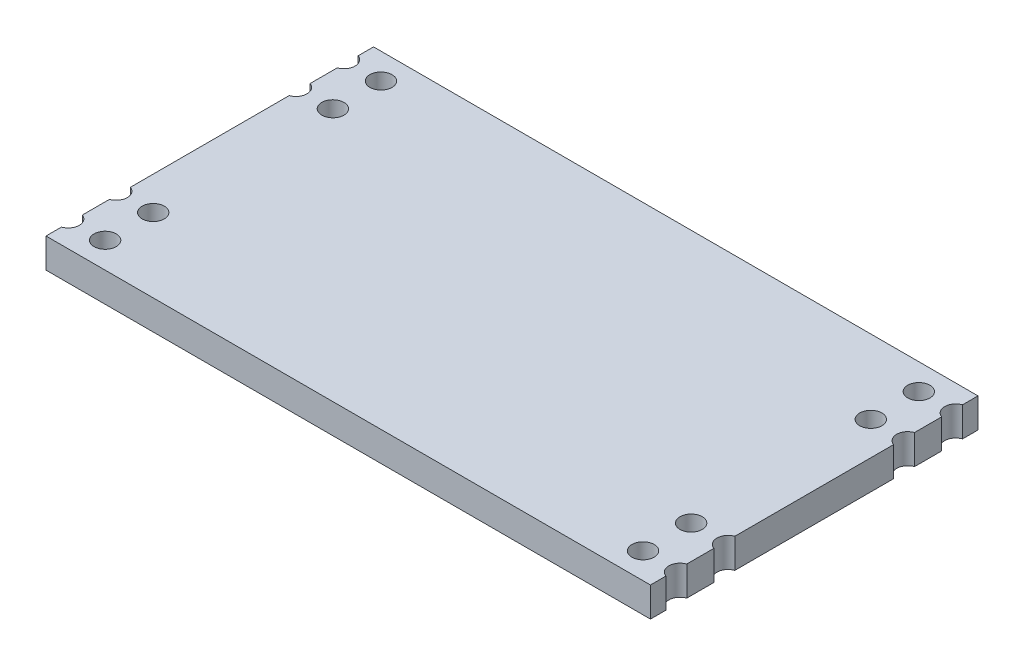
ISO-10303-21;
HEADER;
FILE_DESCRIPTION(('STEP AP214'),'2;1');
FILE_NAME('part.step','',(''),(''),'','','');
FILE_SCHEMA(('AUTOMOTIVE_DESIGN { 1 0 10303 214 1 1 1 1 }'));
ENDSEC;
DATA;
#1=APPLICATION_CONTEXT('core data for automotive mechanical design processes');
#2=APPLICATION_PROTOCOL_DEFINITION('international standard','automotive_design',2000,#1);
#3=PRODUCT_CONTEXT('',#1,'mechanical');
#4=PRODUCT('Part','Part','',(#3));
#5=PRODUCT_RELATED_PRODUCT_CATEGORY('part','',(#4));
#6=PRODUCT_DEFINITION_FORMATION('','',#4);
#7=PRODUCT_DEFINITION_CONTEXT('part definition',#1,'design');
#8=PRODUCT_DEFINITION('design','',#6,#7);
#9=PRODUCT_DEFINITION_SHAPE('','',#8);
#10=(LENGTH_UNIT() NAMED_UNIT(*) SI_UNIT(.MILLI.,.METRE.));
#11=(NAMED_UNIT(*) PLANE_ANGLE_UNIT() SI_UNIT($,.RADIAN.));
#12=(NAMED_UNIT(*) SI_UNIT($,.STERADIAN.) SOLID_ANGLE_UNIT());
#13=UNCERTAINTY_MEASURE_WITH_UNIT(LENGTH_MEASURE(1.E-05),#10,'distance_accuracy_value','');
#14=(GEOMETRIC_REPRESENTATION_CONTEXT(3) GLOBAL_UNCERTAINTY_ASSIGNED_CONTEXT((#13)) GLOBAL_UNIT_ASSIGNED_CONTEXT((#10,
#11,#12)) REPRESENTATION_CONTEXT('',''));
#15=CARTESIAN_POINT('',(0.,0.,0.));
#16=DIRECTION('',(0.,0.,1.));
#17=DIRECTION('',(1.,0.,0.));
#18=AXIS2_PLACEMENT_3D('',#15,#16,#17);
#19=CARTESIAN_POINT('',(16.35,1.6,-8.86));
#20=DIRECTION('',(-1.,0.,0.));
#21=DIRECTION('',(0.,0.,1.));
#22=AXIS2_PLACEMENT_3D('',#19,#20,#21);
#23=PLANE('',#22);
#24=DIRECTION('',(0.,0.,-1.));
#25=VECTOR('',#24,1.);
#26=CARTESIAN_POINT('',(16.35,0.,-8.86));
#27=LINE('',#26,#25);
#28=CARTESIAN_POINT('',(16.35,0.,8.86));
#29=VERTEX_POINT('',#28);
#30=CARTESIAN_POINT('',(16.35,0.,8.02568542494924));
#31=VERTEX_POINT('',#30);
#32=EDGE_CURVE('E210',#29,#31,#27,.T.);
#33=ORIENTED_EDGE('',*,*,#32,.T.);
#34=DIRECTION('',(0.,1.,0.));
#35=VECTOR('',#34,1.);
#36=CARTESIAN_POINT('',(16.35,0.,8.02568542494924));
#37=LINE('',#36,#35);
#38=CARTESIAN_POINT('',(16.35,1.6,8.02568542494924));
#39=VERTEX_POINT('',#38);
#40=EDGE_CURVE('E67',#31,#39,#37,.T.);
#41=ORIENTED_EDGE('',*,*,#40,.T.);
#42=DIRECTION('',(0.,0.,-1.));
#43=VECTOR('',#42,1.);
#44=CARTESIAN_POINT('',(16.35,1.6,-8.86));
#45=LINE('',#44,#43);
#46=CARTESIAN_POINT('',(16.35,1.6,8.86));
#47=VERTEX_POINT('',#46);
#48=EDGE_CURVE('E311',#47,#39,#45,.T.);
#49=ORIENTED_EDGE('',*,*,#48,.F.);
#50=DIRECTION('',(0.,-1.,0.));
#51=VECTOR('',#50,1.);
#52=CARTESIAN_POINT('',(16.35,1.6,8.86));
#53=LINE('',#52,#51);
#54=EDGE_CURVE('E241',#47,#29,#53,.T.);
#55=ORIENTED_EDGE('',*,*,#54,.T.);
#56=EDGE_LOOP('',(#33,#41,#49,#55));
#57=FACE_BOUND('',#56,.T.);
#58=ADVANCED_FACE('F43',(#57),#23,.F.);
#59=CARTESIAN_POINT('',(16.35,1.6,6.89431457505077));
#60=VERTEX_POINT('',#59);
#61=CARTESIAN_POINT('',(16.35,1.6,5.42568542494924));
#62=VERTEX_POINT('',#61);
#63=EDGE_CURVE('E316',#60,#62,#45,.T.);
#64=ORIENTED_EDGE('',*,*,#63,.F.);
#65=DIRECTION('',(0.,1.,0.));
#66=VECTOR('',#65,1.);
#67=CARTESIAN_POINT('',(16.35,0.,6.89431457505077));
#68=LINE('',#67,#66);
#69=CARTESIAN_POINT('',(16.35,0.,6.89431457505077));
#70=VERTEX_POINT('',#69);
#71=EDGE_CURVE('E339',#60,#70,#68,.F.);
#72=ORIENTED_EDGE('',*,*,#71,.T.);
#73=CARTESIAN_POINT('',(16.35,0.,5.42568542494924));
#74=VERTEX_POINT('',#73);
#75=EDGE_CURVE('E207',#70,#74,#27,.T.);
#76=ORIENTED_EDGE('',*,*,#75,.T.);
#77=DIRECTION('',(0.,1.,0.));
#78=VECTOR('',#77,1.);
#79=CARTESIAN_POINT('',(16.35,0.,5.42568542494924));
#80=LINE('',#79,#78);
#81=EDGE_CURVE('E59',#74,#62,#80,.T.);
#82=ORIENTED_EDGE('',*,*,#81,.T.);
#83=EDGE_LOOP('',(#64,#72,#76,#82));
#84=FACE_BOUND('',#83,.T.);
#85=ADVANCED_FACE('F459',(#84),#23,.F.);
#86=CARTESIAN_POINT('',(-16.35,1.6,-8.86));
#87=DIRECTION('',(1.,0.,0.));
#88=DIRECTION('',(0.,0.,-1.));
#89=AXIS2_PLACEMENT_3D('',#86,#87,#88);
#90=PLANE('',#89);
#91=DIRECTION('',(0.,1.,0.));
#92=VECTOR('',#91,1.);
#93=CARTESIAN_POINT('',(-16.35,0.,6.89431457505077));
#94=LINE('',#93,#92);
#95=CARTESIAN_POINT('',(-16.35,1.6,6.89431457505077));
#96=VERTEX_POINT('',#95);
#97=CARTESIAN_POINT('',(-16.35,0.,6.89431457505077));
#98=VERTEX_POINT('',#97);
#99=EDGE_CURVE('E383',#96,#98,#94,.F.);
#100=ORIENTED_EDGE('',*,*,#99,.F.);
#101=DIRECTION('',(0.,0.,1.));
#102=VECTOR('',#101,1.);
#103=CARTESIAN_POINT('',(-16.35,1.6,-8.86));
#104=LINE('',#103,#102);
#105=CARTESIAN_POINT('',(-16.35,1.6,5.42568542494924));
#106=VERTEX_POINT('',#105);
#107=EDGE_CURVE('E542',#106,#96,#104,.T.);
#108=ORIENTED_EDGE('',*,*,#107,.F.);
#109=DIRECTION('',(0.,1.,0.));
#110=VECTOR('',#109,1.);
#111=CARTESIAN_POINT('',(-16.35,0.,5.42568542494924));
#112=LINE('',#111,#110);
#113=CARTESIAN_POINT('',(-16.35,0.,5.42568542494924));
#114=VERTEX_POINT('',#113);
#115=EDGE_CURVE('E365',#114,#106,#112,.T.);
#116=ORIENTED_EDGE('',*,*,#115,.F.);
#117=DIRECTION('',(0.,0.,1.));
#118=VECTOR('',#117,1.);
#119=CARTESIAN_POINT('',(-16.35,0.,-8.86));
#120=LINE('',#119,#118);
#121=EDGE_CURVE('E230',#114,#98,#120,.T.);
#122=ORIENTED_EDGE('',*,*,#121,.T.);
#123=EDGE_LOOP('',(#100,#108,#116,#122));
#124=FACE_BOUND('',#123,.T.);
#125=ADVANCED_FACE('F463',(#124),#90,.F.);
#126=DIRECTION('',(0.,1.,0.));
#127=VECTOR('',#126,1.);
#128=CARTESIAN_POINT('',(-16.35,0.,8.02568542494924));
#129=LINE('',#128,#127);
#130=CARTESIAN_POINT('',(-16.35,0.,8.02568542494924));
#131=VERTEX_POINT('',#130);
#132=CARTESIAN_POINT('',(-16.35,1.6,8.02568542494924));
#133=VERTEX_POINT('',#132);
#134=EDGE_CURVE('E380',#131,#133,#129,.T.);
#135=ORIENTED_EDGE('',*,*,#134,.F.);
#136=CARTESIAN_POINT('',(-16.35,0.,8.86));
#137=VERTEX_POINT('',#136);
#138=EDGE_CURVE('E224',#131,#137,#120,.T.);
#139=ORIENTED_EDGE('',*,*,#138,.T.);
#140=DIRECTION('',(0.,-1.,0.));
#141=VECTOR('',#140,1.);
#142=CARTESIAN_POINT('',(-16.35,1.6,8.86));
#143=LINE('',#142,#141);
#144=CARTESIAN_POINT('',(-16.35,1.6,8.86));
#145=VERTEX_POINT('',#144);
#146=EDGE_CURVE('E244',#145,#137,#143,.T.);
#147=ORIENTED_EDGE('',*,*,#146,.F.);
#148=EDGE_CURVE('E320',#133,#145,#104,.T.);
#149=ORIENTED_EDGE('',*,*,#148,.F.);
#150=EDGE_LOOP('',(#135,#139,#147,#149));
#151=FACE_BOUND('',#150,.T.);
#152=ADVANCED_FACE('F474',(#151),#90,.F.);
#153=DIRECTION('',(0.,1.,0.));
#154=VECTOR('',#153,1.);
#155=CARTESIAN_POINT('',(-16.35,0.,4.29431457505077));
#156=LINE('',#155,#154);
#157=CARTESIAN_POINT('',(-16.35,1.6,4.29431457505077));
#158=VERTEX_POINT('',#157);
#159=CARTESIAN_POINT('',(-16.35,0.,4.29431457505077));
#160=VERTEX_POINT('',#159);
#161=EDGE_CURVE('E377',#158,#160,#156,.F.);
#162=ORIENTED_EDGE('',*,*,#161,.F.);
#163=CARTESIAN_POINT('',(-16.35,1.6,-4.29431457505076));
#164=VERTEX_POINT('',#163);
#165=EDGE_CURVE('E524',#164,#158,#104,.T.);
#166=ORIENTED_EDGE('',*,*,#165,.F.);
#167=DIRECTION('',(0.,1.,0.));
#168=VECTOR('',#167,1.);
#169=CARTESIAN_POINT('',(-16.35,0.,-4.29431457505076));
#170=LINE('',#169,#168);
#171=CARTESIAN_POINT('',(-16.35,0.,-4.29431457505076));
#172=VERTEX_POINT('',#171);
#173=EDGE_CURVE('E266',#164,#172,#170,.F.);
#174=ORIENTED_EDGE('',*,*,#173,.T.);
#175=EDGE_CURVE('E522',#172,#160,#120,.T.);
#176=ORIENTED_EDGE('',*,*,#175,.T.);
#177=EDGE_LOOP('',(#162,#166,#174,#176));
#178=FACE_BOUND('',#177,.T.);
#179=ADVANCED_FACE('F467',(#178),#90,.F.);
#180=DIRECTION('',(0.,1.,0.));
#181=VECTOR('',#180,1.);
#182=CARTESIAN_POINT('',(16.35,0.,-6.89431457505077));
#183=LINE('',#182,#181);
#184=CARTESIAN_POINT('',(16.35,1.6,-6.89431457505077));
#185=VERTEX_POINT('',#184);
#186=CARTESIAN_POINT('',(16.35,0.,-6.89431457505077));
#187=VERTEX_POINT('',#186);
#188=EDGE_CURVE('E424',#185,#187,#183,.F.);
#189=ORIENTED_EDGE('',*,*,#188,.F.);
#190=CARTESIAN_POINT('',(16.35,1.6,-5.42568542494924));
#191=VERTEX_POINT('',#190);
#192=EDGE_CURVE('E317',#191,#185,#45,.T.);
#193=ORIENTED_EDGE('',*,*,#192,.F.);
#194=DIRECTION('',(0.,1.,0.));
#195=VECTOR('',#194,1.);
#196=CARTESIAN_POINT('',(16.35,0.,-5.42568542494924));
#197=LINE('',#196,#195);
#198=CARTESIAN_POINT('',(16.35,0.,-5.42568542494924));
#199=VERTEX_POINT('',#198);
#200=EDGE_CURVE('E406',#199,#191,#197,.T.);
#201=ORIENTED_EDGE('',*,*,#200,.F.);
#202=EDGE_CURVE('E208',#199,#187,#27,.T.);
#203=ORIENTED_EDGE('',*,*,#202,.T.);
#204=EDGE_LOOP('',(#189,#193,#201,#203));
#205=FACE_BOUND('',#204,.T.);
#206=ADVANCED_FACE('F45',(#205),#23,.F.);
#207=DIRECTION('',(0.,1.,0.));
#208=VECTOR('',#207,1.);
#209=CARTESIAN_POINT('',(16.35,0.,-8.02568542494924));
#210=LINE('',#209,#208);
#211=CARTESIAN_POINT('',(16.35,0.,-8.02568542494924));
#212=VERTEX_POINT('',#211);
#213=CARTESIAN_POINT('',(16.35,1.6,-8.02568542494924));
#214=VERTEX_POINT('',#213);
#215=EDGE_CURVE('E421',#212,#214,#210,.T.);
#216=ORIENTED_EDGE('',*,*,#215,.F.);
#217=CARTESIAN_POINT('',(16.35,0.,-8.86));
#218=VERTEX_POINT('',#217);
#219=EDGE_CURVE('E213',#212,#218,#27,.T.);
#220=ORIENTED_EDGE('',*,*,#219,.T.);
#221=DIRECTION('',(0.,-1.,0.));
#222=VECTOR('',#221,1.);
#223=CARTESIAN_POINT('',(16.35,1.6,-8.86));
#224=LINE('',#223,#222);
#225=CARTESIAN_POINT('',(16.35,1.6,-8.86));
#226=VERTEX_POINT('',#225);
#227=EDGE_CURVE('E11',#226,#218,#224,.T.);
#228=ORIENTED_EDGE('',*,*,#227,.F.);
#229=EDGE_CURVE('E240',#214,#226,#45,.T.);
#230=ORIENTED_EDGE('',*,*,#229,.F.);
#231=EDGE_LOOP('',(#216,#220,#228,#230));
#232=FACE_BOUND('',#231,.T.);
#233=ADVANCED_FACE('F465',(#232),#23,.F.);
#234=CARTESIAN_POINT('',(16.35,1.6,4.29431457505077));
#235=VERTEX_POINT('',#234);
#236=CARTESIAN_POINT('',(16.35,1.6,-4.29431457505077));
#237=VERTEX_POINT('',#236);
#238=EDGE_CURVE('E197',#235,#237,#45,.T.);
#239=ORIENTED_EDGE('',*,*,#238,.F.);
#240=DIRECTION('',(0.,1.,0.));
#241=VECTOR('',#240,1.);
#242=CARTESIAN_POINT('',(16.35,0.,4.29431457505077));
#243=LINE('',#242,#241);
#244=CARTESIAN_POINT('',(16.35,0.,4.29431457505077));
#245=VERTEX_POINT('',#244);
#246=EDGE_CURVE('E181',#235,#245,#243,.F.);
#247=ORIENTED_EDGE('',*,*,#246,.T.);
#248=CARTESIAN_POINT('',(16.35,0.,-4.29431457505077));
#249=VERTEX_POINT('',#248);
#250=EDGE_CURVE('E195',#245,#249,#27,.T.);
#251=ORIENTED_EDGE('',*,*,#250,.T.);
#252=DIRECTION('',(0.,1.,0.));
#253=VECTOR('',#252,1.);
#254=CARTESIAN_POINT('',(16.35,0.,-4.29431457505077));
#255=LINE('',#254,#253);
#256=EDGE_CURVE('E418',#237,#249,#255,.F.);
#257=ORIENTED_EDGE('',*,*,#256,.F.);
#258=EDGE_LOOP('',(#239,#247,#251,#257));
#259=FACE_BOUND('',#258,.T.);
#260=ADVANCED_FACE('F193',(#259),#23,.F.);
#261=CARTESIAN_POINT('',(-16.35,0.,-8.86));
#262=VERTEX_POINT('',#261);
#263=CARTESIAN_POINT('',(-16.35,0.,-8.02568542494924));
#264=VERTEX_POINT('',#263);
#265=EDGE_CURVE('E232',#262,#264,#120,.T.);
#266=ORIENTED_EDGE('',*,*,#265,.T.);
#267=DIRECTION('',(0.,1.,0.));
#268=VECTOR('',#267,1.);
#269=CARTESIAN_POINT('',(-16.35,0.,-8.02568542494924));
#270=LINE('',#269,#268);
#271=CARTESIAN_POINT('',(-16.35,1.6,-8.02568542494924));
#272=VERTEX_POINT('',#271);
#273=EDGE_CURVE('E292',#264,#272,#270,.T.);
#274=ORIENTED_EDGE('',*,*,#273,.T.);
#275=CARTESIAN_POINT('',(-16.35,1.6,-8.86));
#276=VERTEX_POINT('',#275);
#277=EDGE_CURVE('E255',#276,#272,#104,.T.);
#278=ORIENTED_EDGE('',*,*,#277,.F.);
#279=DIRECTION('',(0.,-1.,0.));
#280=VECTOR('',#279,1.);
#281=CARTESIAN_POINT('',(-16.35,1.6,-8.86));
#282=LINE('',#281,#280);
#283=EDGE_CURVE('E52',#276,#262,#282,.T.);
#284=ORIENTED_EDGE('',*,*,#283,.T.);
#285=EDGE_LOOP('',(#266,#274,#278,#284));
#286=FACE_BOUND('',#285,.T.);
#287=ADVANCED_FACE('F252',(#286),#90,.F.);
#288=CARTESIAN_POINT('',(-16.35,1.6,-6.89431457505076));
#289=VERTEX_POINT('',#288);
#290=CARTESIAN_POINT('',(-16.35,1.6,-5.42568542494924));
#291=VERTEX_POINT('',#290);
#292=EDGE_CURVE('E322',#289,#291,#104,.T.);
#293=ORIENTED_EDGE('',*,*,#292,.F.);
#294=DIRECTION('',(0.,1.,0.));
#295=VECTOR('',#294,1.);
#296=CARTESIAN_POINT('',(-16.35,0.,-6.89431457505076));
#297=LINE('',#296,#295);
#298=CARTESIAN_POINT('',(-16.35,0.,-6.89431457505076));
#299=VERTEX_POINT('',#298);
#300=EDGE_CURVE('E289',#289,#299,#297,.F.);
#301=ORIENTED_EDGE('',*,*,#300,.T.);
#302=CARTESIAN_POINT('',(-16.35,0.,-5.42568542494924));
#303=VERTEX_POINT('',#302);
#304=EDGE_CURVE('E237',#299,#303,#120,.T.);
#305=ORIENTED_EDGE('',*,*,#304,.T.);
#306=DIRECTION('',(0.,1.,0.));
#307=VECTOR('',#306,1.);
#308=CARTESIAN_POINT('',(-16.35,0.,-5.42568542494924));
#309=LINE('',#308,#307);
#310=EDGE_CURVE('E272',#303,#291,#309,.T.);
#311=ORIENTED_EDGE('',*,*,#310,.T.);
#312=EDGE_LOOP('',(#293,#301,#305,#311));
#313=FACE_BOUND('',#312,.T.);
#314=ADVANCED_FACE('F482',(#313),#90,.F.);
#315=CARTESIAN_POINT('',(-16.35,1.6,-8.86));
#316=DIRECTION('',(0.,0.,1.));
#317=DIRECTION('',(1.,0.,0.));
#318=AXIS2_PLACEMENT_3D('',#315,#316,#317);
#319=PLANE('',#318);
#320=DIRECTION('',(-1.,0.,0.));
#321=VECTOR('',#320,1.);
#322=CARTESIAN_POINT('',(-16.35,0.,-8.86));
#323=LINE('',#322,#321);
#324=EDGE_CURVE('E219',#218,#262,#323,.T.);
#325=ORIENTED_EDGE('',*,*,#324,.T.);
#326=ORIENTED_EDGE('',*,*,#283,.F.);
#327=DIRECTION('',(-1.,0.,0.));
#328=VECTOR('',#327,1.);
#329=CARTESIAN_POINT('',(-16.35,1.6,-8.86));
#330=LINE('',#329,#328);
#331=EDGE_CURVE('E315',#226,#276,#330,.T.);
#332=ORIENTED_EDGE('',*,*,#331,.F.);
#333=ORIENTED_EDGE('',*,*,#227,.T.);
#334=EDGE_LOOP('',(#325,#326,#332,#333));
#335=FACE_BOUND('',#334,.T.);
#336=ADVANCED_FACE('F486',(#335),#319,.F.);
#337=CARTESIAN_POINT('',(-16.35,1.6,8.86));
#338=DIRECTION('',(0.,0.,-1.));
#339=DIRECTION('',(-1.,0.,0.));
#340=AXIS2_PLACEMENT_3D('',#337,#338,#339);
#341=PLANE('',#340);
#342=DIRECTION('',(1.,0.,0.));
#343=VECTOR('',#342,1.);
#344=CARTESIAN_POINT('',(-16.35,0.,8.86));
#345=LINE('',#344,#343);
#346=EDGE_CURVE('E236',#137,#29,#345,.T.);
#347=ORIENTED_EDGE('',*,*,#346,.T.);
#348=ORIENTED_EDGE('',*,*,#54,.F.);
#349=DIRECTION('',(1.,0.,0.));
#350=VECTOR('',#349,1.);
#351=CARTESIAN_POINT('',(-16.35,1.6,8.86));
#352=LINE('',#351,#350);
#353=EDGE_CURVE('E245',#145,#47,#352,.T.);
#354=ORIENTED_EDGE('',*,*,#353,.F.);
#355=ORIENTED_EDGE('',*,*,#146,.T.);
#356=EDGE_LOOP('',(#347,#348,#354,#355));
#357=FACE_BOUND('',#356,.T.);
#358=ADVANCED_FACE('F335',(#357),#341,.F.);
#359=CARTESIAN_POINT('',(0.,1.6,0.));
#360=DIRECTION('',(0.,1.,0.));
#361=DIRECTION('',(0.,0.,1.));
#362=AXIS2_PLACEMENT_3D('',#359,#360,#361);
#363=PLANE('',#362);
#364=CARTESIAN_POINT('',(16.55,1.6,7.46));
#365=DIRECTION('',(0.,1.,0.));
#366=DIRECTION('',(0.,0.,-1.));
#367=AXIS2_PLACEMENT_3D('',#364,#365,#366);
#368=CIRCLE('',#367,0.6);
#369=EDGE_CURVE('E188',#60,#39,#368,.T.);
#370=ORIENTED_EDGE('',*,*,#369,.F.);
#371=ORIENTED_EDGE('',*,*,#63,.T.);
#372=CARTESIAN_POINT('',(16.55,1.6,4.86));
#373=DIRECTION('',(0.,1.,0.));
#374=DIRECTION('',(0.,0.,-1.));
#375=AXIS2_PLACEMENT_3D('',#372,#373,#374);
#376=CIRCLE('',#375,0.6);
#377=EDGE_CURVE('E189',#235,#62,#376,.T.);
#378=ORIENTED_EDGE('',*,*,#377,.F.);
#379=ORIENTED_EDGE('',*,*,#238,.T.);
#380=CARTESIAN_POINT('',(16.55,1.6,-4.86));
#381=DIRECTION('',(0.,-1.,0.));
#382=DIRECTION('',(0.,0.,1.));
#383=AXIS2_PLACEMENT_3D('',#380,#381,#382);
#384=CIRCLE('',#383,0.6);
#385=EDGE_CURVE('E391',#237,#191,#384,.T.);
#386=ORIENTED_EDGE('',*,*,#385,.T.);
#387=ORIENTED_EDGE('',*,*,#192,.T.);
#388=CARTESIAN_POINT('',(16.55,1.6,-7.46));
#389=DIRECTION('',(0.,-1.,0.));
#390=DIRECTION('',(0.,0.,1.));
#391=AXIS2_PLACEMENT_3D('',#388,#389,#390);
#392=CIRCLE('',#391,0.6);
#393=EDGE_CURVE('E407',#185,#214,#392,.T.);
#394=ORIENTED_EDGE('',*,*,#393,.T.);
#395=ORIENTED_EDGE('',*,*,#229,.T.);
#396=ORIENTED_EDGE('',*,*,#331,.T.);
#397=ORIENTED_EDGE('',*,*,#277,.T.);
#398=CARTESIAN_POINT('',(-16.55,1.6,-7.46));
#399=DIRECTION('',(0.,1.,0.));
#400=DIRECTION('',(0.,0.,1.));
#401=AXIS2_PLACEMENT_3D('',#398,#399,#400);
#402=CIRCLE('',#401,0.6);
#403=EDGE_CURVE('E267',#289,#272,#402,.T.);
#404=ORIENTED_EDGE('',*,*,#403,.F.);
#405=ORIENTED_EDGE('',*,*,#292,.T.);
#406=CARTESIAN_POINT('',(-16.55,1.6,-4.86));
#407=DIRECTION('',(0.,1.,0.));
#408=DIRECTION('',(0.,0.,1.));
#409=AXIS2_PLACEMENT_3D('',#406,#407,#408);
#410=CIRCLE('',#409,0.6);
#411=EDGE_CURVE('E282',#164,#291,#410,.T.);
#412=ORIENTED_EDGE('',*,*,#411,.F.);
#413=ORIENTED_EDGE('',*,*,#165,.T.);
#414=CARTESIAN_POINT('',(-16.55,1.6,4.86));
#415=DIRECTION('',(0.,-1.,0.));
#416=DIRECTION('',(0.,0.,-1.));
#417=AXIS2_PLACEMENT_3D('',#414,#415,#416);
#418=CIRCLE('',#417,0.6);
#419=EDGE_CURVE('E354',#158,#106,#418,.T.);
#420=ORIENTED_EDGE('',*,*,#419,.T.);
#421=ORIENTED_EDGE('',*,*,#107,.T.);
#422=CARTESIAN_POINT('',(-16.55,1.6,7.46));
#423=DIRECTION('',(0.,-1.,0.));
#424=DIRECTION('',(0.,0.,-1.));
#425=AXIS2_PLACEMENT_3D('',#422,#423,#424);
#426=CIRCLE('',#425,0.6);
#427=EDGE_CURVE('E366',#96,#133,#426,.T.);
#428=ORIENTED_EDGE('',*,*,#427,.T.);
#429=ORIENTED_EDGE('',*,*,#148,.T.);
#430=ORIENTED_EDGE('',*,*,#353,.T.);
#431=ORIENTED_EDGE('',*,*,#48,.T.);
#432=EDGE_LOOP('',(#370,#371,#378,#379,#386,#387,#394,#395,#396,#397,#404,#405,#412,#413,#420,
#421,#428,#429,#430,#431));
#433=FACE_BOUND('',#432,.T.);
#434=CARTESIAN_POINT('',(14.55,1.6,7.46));
#435=DIRECTION('',(0.,1.,0.));
#436=DIRECTION('',(0.,0.,-1.));
#437=AXIS2_PLACEMENT_3D('',#434,#435,#436);
#438=CIRCLE('',#437,0.6);
#439=CARTESIAN_POINT('',(14.55,1.6,6.86));
#440=VERTEX_POINT('',#439);
#441=EDGE_CURVE('E355',#440,#440,#438,.T.);
#442=ORIENTED_EDGE('',*,*,#441,.F.);
#443=EDGE_LOOP('',(#442));
#444=FACE_BOUND('',#443,.T.);
#445=CARTESIAN_POINT('',(14.55,1.6,4.86));
#446=DIRECTION('',(0.,1.,0.));
#447=DIRECTION('',(0.,0.,-1.));
#448=AXIS2_PLACEMENT_3D('',#445,#446,#447);
#449=CIRCLE('',#448,0.6);
#450=CARTESIAN_POINT('',(14.55,1.6,4.26));
#451=VERTEX_POINT('',#450);
#452=EDGE_CURVE('E338',#451,#451,#449,.T.);
#453=ORIENTED_EDGE('',*,*,#452,.F.);
#454=EDGE_LOOP('',(#453));
#455=FACE_BOUND('',#454,.T.);
#456=CARTESIAN_POINT('',(-14.55,1.6,7.46));
#457=DIRECTION('',(0.,-1.,0.));
#458=DIRECTION('',(0.,0.,-1.));
#459=AXIS2_PLACEMENT_3D('',#456,#457,#458);
#460=CIRCLE('',#459,0.6);
#461=CARTESIAN_POINT('',(-14.55,1.6,6.86));
#462=VERTEX_POINT('',#461);
#463=EDGE_CURVE('E392',#462,#462,#460,.T.);
#464=ORIENTED_EDGE('',*,*,#463,.T.);
#465=EDGE_LOOP('',(#464));
#466=FACE_BOUND('',#465,.T.);
#467=CARTESIAN_POINT('',(-14.55,1.6,4.86));
#468=DIRECTION('',(0.,-1.,0.));
#469=DIRECTION('',(0.,0.,-1.));
#470=AXIS2_PLACEMENT_3D('',#467,#468,#469);
#471=CIRCLE('',#470,0.6);
#472=CARTESIAN_POINT('',(-14.55,1.6,4.26));
#473=VERTEX_POINT('',#472);
#474=EDGE_CURVE('E386',#473,#473,#471,.T.);
#475=ORIENTED_EDGE('',*,*,#474,.T.);
#476=EDGE_LOOP('',(#475));
#477=FACE_BOUND('',#476,.T.);
#478=CARTESIAN_POINT('',(14.55,1.6,-7.46));
#479=DIRECTION('',(0.,-1.,0.));
#480=DIRECTION('',(0.,0.,1.));
#481=AXIS2_PLACEMENT_3D('',#478,#479,#480);
#482=CIRCLE('',#481,0.6);
#483=CARTESIAN_POINT('',(14.55,1.6,-6.86));
#484=VERTEX_POINT('',#483);
#485=EDGE_CURVE('E430',#484,#484,#482,.T.);
#486=ORIENTED_EDGE('',*,*,#485,.T.);
#487=EDGE_LOOP('',(#486));
#488=FACE_BOUND('',#487,.T.);
#489=CARTESIAN_POINT('',(14.55,1.6,-4.86));
#490=DIRECTION('',(0.,-1.,0.));
#491=DIRECTION('',(0.,0.,1.));
#492=AXIS2_PLACEMENT_3D('',#489,#490,#491);
#493=CIRCLE('',#492,0.6);
#494=CARTESIAN_POINT('',(14.55,1.6,-4.26));
#495=VERTEX_POINT('',#494);
#496=EDGE_CURVE('E277',#495,#495,#493,.T.);
#497=ORIENTED_EDGE('',*,*,#496,.T.);
#498=EDGE_LOOP('',(#497));
#499=FACE_BOUND('',#498,.T.);
#500=CARTESIAN_POINT('',(-14.55,1.6,-7.46));
#501=DIRECTION('',(0.,1.,0.));
#502=DIRECTION('',(0.,0.,1.));
#503=AXIS2_PLACEMENT_3D('',#500,#501,#502);
#504=CIRCLE('',#503,0.6);
#505=CARTESIAN_POINT('',(-14.55,1.6,-6.86));
#506=VERTEX_POINT('',#505);
#507=EDGE_CURVE('E300',#506,#506,#504,.T.);
#508=ORIENTED_EDGE('',*,*,#507,.F.);
#509=EDGE_LOOP('',(#508));
#510=FACE_BOUND('',#509,.T.);
#511=CARTESIAN_POINT('',(-14.55,1.6,-4.86));
#512=DIRECTION('',(0.,1.,0.));
#513=DIRECTION('',(0.,0.,1.));
#514=AXIS2_PLACEMENT_3D('',#511,#512,#513);
#515=CIRCLE('',#514,0.6);
#516=CARTESIAN_POINT('',(-14.55,1.6,-4.26));
#517=VERTEX_POINT('',#516);
#518=EDGE_CURVE('E295',#517,#517,#515,.T.);
#519=ORIENTED_EDGE('',*,*,#518,.F.);
#520=EDGE_LOOP('',(#519));
#521=FACE_BOUND('',#520,.T.);
#522=ADVANCED_FACE('F328',(#433,#444,#455,#466,#477,#488,#499,#510,#521),#363,.T.);
#523=CARTESIAN_POINT('',(0.,0.,0.));
#524=DIRECTION('',(0.,1.,0.));
#525=DIRECTION('',(0.,0.,1.));
#526=AXIS2_PLACEMENT_3D('',#523,#524,#525);
#527=PLANE('',#526);
#528=CARTESIAN_POINT('',(14.55,0.,7.46));
#529=DIRECTION('',(0.,1.,0.));
#530=DIRECTION('',(0.,0.,-1.));
#531=AXIS2_PLACEMENT_3D('',#528,#529,#530);
#532=CIRCLE('',#531,0.6);
#533=CARTESIAN_POINT('',(14.55,0.,6.86));
#534=VERTEX_POINT('',#533);
#535=EDGE_CURVE('E350',#534,#534,#532,.T.);
#536=ORIENTED_EDGE('',*,*,#535,.T.);
#537=EDGE_LOOP('',(#536));
#538=FACE_BOUND('',#537,.T.);
#539=CARTESIAN_POINT('',(14.55,0.,4.86));
#540=DIRECTION('',(0.,1.,0.));
#541=DIRECTION('',(0.,0.,-1.));
#542=AXIS2_PLACEMENT_3D('',#539,#540,#541);
#543=CIRCLE('',#542,0.6);
#544=CARTESIAN_POINT('',(14.55,0.,4.26));
#545=VERTEX_POINT('',#544);
#546=EDGE_CURVE('E344',#545,#545,#543,.T.);
#547=ORIENTED_EDGE('',*,*,#546,.T.);
#548=EDGE_LOOP('',(#547));
#549=FACE_BOUND('',#548,.T.);
#550=ORIENTED_EDGE('',*,*,#75,.F.);
#551=CARTESIAN_POINT('',(16.55,0.,7.46));
#552=DIRECTION('',(0.,1.,0.));
#553=DIRECTION('',(0.,0.,-1.));
#554=AXIS2_PLACEMENT_3D('',#551,#552,#553);
#555=CIRCLE('',#554,0.6);
#556=EDGE_CURVE('E199',#70,#31,#555,.T.);
#557=ORIENTED_EDGE('',*,*,#556,.T.);
#558=ORIENTED_EDGE('',*,*,#32,.F.);
#559=ORIENTED_EDGE('',*,*,#346,.F.);
#560=ORIENTED_EDGE('',*,*,#138,.F.);
#561=CARTESIAN_POINT('',(-16.55,0.,7.46));
#562=DIRECTION('',(0.,-1.,0.));
#563=DIRECTION('',(0.,0.,-1.));
#564=AXIS2_PLACEMENT_3D('',#561,#562,#563);
#565=CIRCLE('',#564,0.6);
#566=EDGE_CURVE('E362',#98,#131,#565,.T.);
#567=ORIENTED_EDGE('',*,*,#566,.F.);
#568=ORIENTED_EDGE('',*,*,#121,.F.);
#569=CARTESIAN_POINT('',(-16.55,0.,4.86));
#570=DIRECTION('',(0.,-1.,0.));
#571=DIRECTION('',(0.,0.,-1.));
#572=AXIS2_PLACEMENT_3D('',#569,#570,#571);
#573=CIRCLE('',#572,0.6);
#574=EDGE_CURVE('E369',#160,#114,#573,.T.);
#575=ORIENTED_EDGE('',*,*,#574,.F.);
#576=ORIENTED_EDGE('',*,*,#175,.F.);
#577=CARTESIAN_POINT('',(-16.55,0.,-4.86));
#578=DIRECTION('',(0.,1.,0.));
#579=DIRECTION('',(0.,0.,1.));
#580=AXIS2_PLACEMENT_3D('',#577,#578,#579);
#581=CIRCLE('',#580,0.6);
#582=EDGE_CURVE('E274',#172,#303,#581,.T.);
#583=ORIENTED_EDGE('',*,*,#582,.T.);
#584=ORIENTED_EDGE('',*,*,#304,.F.);
#585=CARTESIAN_POINT('',(-16.55,0.,-7.46));
#586=DIRECTION('',(0.,1.,0.));
#587=DIRECTION('',(0.,0.,1.));
#588=AXIS2_PLACEMENT_3D('',#585,#586,#587);
#589=CIRCLE('',#588,0.6);
#590=EDGE_CURVE('E260',#299,#264,#589,.T.);
#591=ORIENTED_EDGE('',*,*,#590,.T.);
#592=ORIENTED_EDGE('',*,*,#265,.F.);
#593=ORIENTED_EDGE('',*,*,#324,.F.);
#594=ORIENTED_EDGE('',*,*,#219,.F.);
#595=CARTESIAN_POINT('',(16.55,0.,-7.46));
#596=DIRECTION('',(0.,-1.,0.));
#597=DIRECTION('',(0.,0.,1.));
#598=AXIS2_PLACEMENT_3D('',#595,#596,#597);
#599=CIRCLE('',#598,0.6);
#600=EDGE_CURVE('E403',#187,#212,#599,.T.);
#601=ORIENTED_EDGE('',*,*,#600,.F.);
#602=ORIENTED_EDGE('',*,*,#202,.F.);
#603=CARTESIAN_POINT('',(16.55,0.,-4.86));
#604=DIRECTION('',(0.,-1.,0.));
#605=DIRECTION('',(0.,0.,1.));
#606=AXIS2_PLACEMENT_3D('',#603,#604,#605);
#607=CIRCLE('',#606,0.6);
#608=EDGE_CURVE('E205',#249,#199,#607,.T.);
#609=ORIENTED_EDGE('',*,*,#608,.F.);
#610=ORIENTED_EDGE('',*,*,#250,.F.);
#611=CARTESIAN_POINT('',(16.55,0.,4.86));
#612=DIRECTION('',(0.,1.,0.));
#613=DIRECTION('',(0.,0.,-1.));
#614=AXIS2_PLACEMENT_3D('',#611,#612,#613);
#615=CIRCLE('',#614,0.6);
#616=EDGE_CURVE('E178',#245,#74,#615,.T.);
#617=ORIENTED_EDGE('',*,*,#616,.T.);
#618=EDGE_LOOP('',(#550,#557,#558,#559,#560,#567,#568,#575,#576,#583,#584,#591,#592,#593,#594,
#601,#602,#609,#610,#617));
#619=FACE_BOUND('',#618,.T.);
#620=CARTESIAN_POINT('',(-14.55,0.,7.46));
#621=DIRECTION('',(0.,-1.,0.));
#622=DIRECTION('',(0.,0.,-1.));
#623=AXIS2_PLACEMENT_3D('',#620,#621,#622);
#624=CIRCLE('',#623,0.6);
#625=CARTESIAN_POINT('',(-14.55,0.,6.86));
#626=VERTEX_POINT('',#625);
#627=EDGE_CURVE('E387',#626,#626,#624,.T.);
#628=ORIENTED_EDGE('',*,*,#627,.F.);
#629=EDGE_LOOP('',(#628));
#630=FACE_BOUND('',#629,.T.);
#631=CARTESIAN_POINT('',(-14.55,0.,4.86));
#632=DIRECTION('',(0.,-1.,0.));
#633=DIRECTION('',(0.,0.,-1.));
#634=AXIS2_PLACEMENT_3D('',#631,#632,#633);
#635=CIRCLE('',#634,0.6);
#636=CARTESIAN_POINT('',(-14.55,0.,4.26));
#637=VERTEX_POINT('',#636);
#638=EDGE_CURVE('E396',#637,#637,#635,.T.);
#639=ORIENTED_EDGE('',*,*,#638,.F.);
#640=EDGE_LOOP('',(#639));
#641=FACE_BOUND('',#640,.T.);
#642=CARTESIAN_POINT('',(14.55,0.,-7.46));
#643=DIRECTION('',(0.,-1.,0.));
#644=DIRECTION('',(0.,0.,1.));
#645=AXIS2_PLACEMENT_3D('',#642,#643,#644);
#646=CIRCLE('',#645,0.6);
#647=CARTESIAN_POINT('',(14.55,0.,-6.86));
#648=VERTEX_POINT('',#647);
#649=EDGE_CURVE('E284',#648,#648,#646,.T.);
#650=ORIENTED_EDGE('',*,*,#649,.F.);
#651=EDGE_LOOP('',(#650));
#652=FACE_BOUND('',#651,.T.);
#653=CARTESIAN_POINT('',(14.55,0.,-4.86));
#654=DIRECTION('',(0.,-1.,0.));
#655=DIRECTION('',(0.,0.,1.));
#656=AXIS2_PLACEMENT_3D('',#653,#654,#655);
#657=CIRCLE('',#656,0.6);
#658=CARTESIAN_POINT('',(14.55,0.,-4.26));
#659=VERTEX_POINT('',#658);
#660=EDGE_CURVE('E433',#659,#659,#657,.T.);
#661=ORIENTED_EDGE('',*,*,#660,.F.);
#662=EDGE_LOOP('',(#661));
#663=FACE_BOUND('',#662,.T.);
#664=CARTESIAN_POINT('',(-14.55,0.,-7.46));
#665=DIRECTION('',(0.,1.,0.));
#666=DIRECTION('',(0.,0.,1.));
#667=AXIS2_PLACEMENT_3D('',#664,#665,#666);
#668=CIRCLE('',#667,0.6);
#669=CARTESIAN_POINT('',(-14.55,0.,-6.86));
#670=VERTEX_POINT('',#669);
#671=EDGE_CURVE('E296',#670,#670,#668,.T.);
#672=ORIENTED_EDGE('',*,*,#671,.T.);
#673=EDGE_LOOP('',(#672));
#674=FACE_BOUND('',#673,.T.);
#675=CARTESIAN_POINT('',(-14.55,0.,-4.86));
#676=DIRECTION('',(0.,1.,0.));
#677=DIRECTION('',(0.,0.,1.));
#678=AXIS2_PLACEMENT_3D('',#675,#676,#677);
#679=CIRCLE('',#678,0.6);
#680=CARTESIAN_POINT('',(-14.55,0.,-4.26));
#681=VERTEX_POINT('',#680);
#682=EDGE_CURVE('E304',#681,#681,#679,.T.);
#683=ORIENTED_EDGE('',*,*,#682,.T.);
#684=EDGE_LOOP('',(#683));
#685=FACE_BOUND('',#684,.T.);
#686=ADVANCED_FACE('F202',(#538,#549,#619,#630,#641,#652,#663,#674,#685),#527,.F.);
#687=CARTESIAN_POINT('',(-14.55,0.,-4.86));
#688=DIRECTION('',(0.,1.,0.));
#689=DIRECTION('',(0.,0.,1.));
#690=AXIS2_PLACEMENT_3D('',#687,#688,#689);
#691=CYLINDRICAL_SURFACE('',#690,0.6);
#692=ORIENTED_EDGE('',*,*,#682,.F.);
#693=EDGE_LOOP('',(#692));
#694=FACE_BOUND('',#693,.T.);
#695=ORIENTED_EDGE('',*,*,#518,.T.);
#696=EDGE_LOOP('',(#695));
#697=FACE_BOUND('',#696,.T.);
#698=ADVANCED_FACE('F503',(#694,#697),#691,.F.);
#699=CARTESIAN_POINT('',(-14.55,0.,-7.46));
#700=DIRECTION('',(0.,1.,0.));
#701=DIRECTION('',(0.,0.,1.));
#702=AXIS2_PLACEMENT_3D('',#699,#700,#701);
#703=CYLINDRICAL_SURFACE('',#702,0.6);
#704=ORIENTED_EDGE('',*,*,#671,.F.);
#705=EDGE_LOOP('',(#704));
#706=FACE_BOUND('',#705,.T.);
#707=ORIENTED_EDGE('',*,*,#507,.T.);
#708=EDGE_LOOP('',(#707));
#709=FACE_BOUND('',#708,.T.);
#710=ADVANCED_FACE('F508',(#706,#709),#703,.F.);
#711=CARTESIAN_POINT('',(-16.55,0.,-4.86));
#712=DIRECTION('',(0.,1.,0.));
#713=DIRECTION('',(0.,0.,1.));
#714=AXIS2_PLACEMENT_3D('',#711,#712,#713);
#715=CYLINDRICAL_SURFACE('',#714,0.6);
#716=ORIENTED_EDGE('',*,*,#582,.F.);
#717=ORIENTED_EDGE('',*,*,#173,.F.);
#718=ORIENTED_EDGE('',*,*,#411,.T.);
#719=ORIENTED_EDGE('',*,*,#310,.F.);
#720=EDGE_LOOP('',(#716,#717,#718,#719));
#721=FACE_BOUND('',#720,.T.);
#722=ADVANCED_FACE('F456',(#721),#715,.F.);
#723=CARTESIAN_POINT('',(-16.55,0.,-7.46));
#724=DIRECTION('',(0.,1.,0.));
#725=DIRECTION('',(0.,0.,1.));
#726=AXIS2_PLACEMENT_3D('',#723,#724,#725);
#727=CYLINDRICAL_SURFACE('',#726,0.6);
#728=ORIENTED_EDGE('',*,*,#590,.F.);
#729=ORIENTED_EDGE('',*,*,#300,.F.);
#730=ORIENTED_EDGE('',*,*,#403,.T.);
#731=ORIENTED_EDGE('',*,*,#273,.F.);
#732=EDGE_LOOP('',(#728,#729,#730,#731));
#733=FACE_BOUND('',#732,.T.);
#734=ADVANCED_FACE('F447',(#733),#727,.F.);
#735=CARTESIAN_POINT('',(14.55,0.,-4.86));
#736=DIRECTION('',(0.,1.,0.));
#737=DIRECTION('',(0.,0.,1.));
#738=AXIS2_PLACEMENT_3D('',#735,#736,#737);
#739=CYLINDRICAL_SURFACE('',#738,0.6);
#740=ORIENTED_EDGE('',*,*,#660,.T.);
#741=EDGE_LOOP('',(#740));
#742=FACE_BOUND('',#741,.T.);
#743=ORIENTED_EDGE('',*,*,#496,.F.);
#744=EDGE_LOOP('',(#743));
#745=FACE_BOUND('',#744,.T.);
#746=ADVANCED_FACE('F444',(#742,#745),#739,.F.);
#747=CARTESIAN_POINT('',(14.55,0.,-7.46));
#748=DIRECTION('',(0.,1.,0.));
#749=DIRECTION('',(0.,0.,1.));
#750=AXIS2_PLACEMENT_3D('',#747,#748,#749);
#751=CYLINDRICAL_SURFACE('',#750,0.6);
#752=ORIENTED_EDGE('',*,*,#649,.T.);
#753=EDGE_LOOP('',(#752));
#754=FACE_BOUND('',#753,.T.);
#755=ORIENTED_EDGE('',*,*,#485,.F.);
#756=EDGE_LOOP('',(#755));
#757=FACE_BOUND('',#756,.T.);
#758=ADVANCED_FACE('F446',(#754,#757),#751,.F.);
#759=CARTESIAN_POINT('',(16.55,0.,-4.86));
#760=DIRECTION('',(0.,1.,0.));
#761=DIRECTION('',(0.,0.,1.));
#762=AXIS2_PLACEMENT_3D('',#759,#760,#761);
#763=CYLINDRICAL_SURFACE('',#762,0.6);
#764=ORIENTED_EDGE('',*,*,#256,.T.);
#765=ORIENTED_EDGE('',*,*,#608,.T.);
#766=ORIENTED_EDGE('',*,*,#200,.T.);
#767=ORIENTED_EDGE('',*,*,#385,.F.);
#768=EDGE_LOOP('',(#764,#765,#766,#767));
#769=FACE_BOUND('',#768,.T.);
#770=ADVANCED_FACE('F453',(#769),#763,.F.);
#771=CARTESIAN_POINT('',(16.55,0.,-7.46));
#772=DIRECTION('',(0.,1.,0.));
#773=DIRECTION('',(0.,0.,1.));
#774=AXIS2_PLACEMENT_3D('',#771,#772,#773);
#775=CYLINDRICAL_SURFACE('',#774,0.6);
#776=ORIENTED_EDGE('',*,*,#188,.T.);
#777=ORIENTED_EDGE('',*,*,#600,.T.);
#778=ORIENTED_EDGE('',*,*,#215,.T.);
#779=ORIENTED_EDGE('',*,*,#393,.F.);
#780=EDGE_LOOP('',(#776,#777,#778,#779));
#781=FACE_BOUND('',#780,.T.);
#782=ADVANCED_FACE('F602',(#781),#775,.F.);
#783=CARTESIAN_POINT('',(-14.55,0.,4.86));
#784=DIRECTION('',(0.,1.,0.));
#785=DIRECTION('',(0.,0.,1.));
#786=AXIS2_PLACEMENT_3D('',#783,#784,#785);
#787=CYLINDRICAL_SURFACE('',#786,0.6);
#788=ORIENTED_EDGE('',*,*,#638,.T.);
#789=EDGE_LOOP('',(#788));
#790=FACE_BOUND('',#789,.T.);
#791=ORIENTED_EDGE('',*,*,#474,.F.);
#792=EDGE_LOOP('',(#791));
#793=FACE_BOUND('',#792,.T.);
#794=ADVANCED_FACE('F598',(#790,#793),#787,.F.);
#795=CARTESIAN_POINT('',(-14.55,0.,7.46));
#796=DIRECTION('',(0.,1.,0.));
#797=DIRECTION('',(0.,0.,1.));
#798=AXIS2_PLACEMENT_3D('',#795,#796,#797);
#799=CYLINDRICAL_SURFACE('',#798,0.6);
#800=ORIENTED_EDGE('',*,*,#627,.T.);
#801=EDGE_LOOP('',(#800));
#802=FACE_BOUND('',#801,.T.);
#803=ORIENTED_EDGE('',*,*,#463,.F.);
#804=EDGE_LOOP('',(#803));
#805=FACE_BOUND('',#804,.T.);
#806=ADVANCED_FACE('F594',(#802,#805),#799,.F.);
#807=CARTESIAN_POINT('',(-16.55,0.,4.86));
#808=DIRECTION('',(0.,1.,0.));
#809=DIRECTION('',(0.,0.,1.));
#810=AXIS2_PLACEMENT_3D('',#807,#808,#809);
#811=CYLINDRICAL_SURFACE('',#810,0.6);
#812=ORIENTED_EDGE('',*,*,#161,.T.);
#813=ORIENTED_EDGE('',*,*,#574,.T.);
#814=ORIENTED_EDGE('',*,*,#115,.T.);
#815=ORIENTED_EDGE('',*,*,#419,.F.);
#816=EDGE_LOOP('',(#812,#813,#814,#815));
#817=FACE_BOUND('',#816,.T.);
#818=ADVANCED_FACE('F591',(#817),#811,.F.);
#819=CARTESIAN_POINT('',(-16.55,0.,7.46));
#820=DIRECTION('',(0.,1.,0.));
#821=DIRECTION('',(0.,0.,1.));
#822=AXIS2_PLACEMENT_3D('',#819,#820,#821);
#823=CYLINDRICAL_SURFACE('',#822,0.6);
#824=ORIENTED_EDGE('',*,*,#99,.T.);
#825=ORIENTED_EDGE('',*,*,#566,.T.);
#826=ORIENTED_EDGE('',*,*,#134,.T.);
#827=ORIENTED_EDGE('',*,*,#427,.F.);
#828=EDGE_LOOP('',(#824,#825,#826,#827));
#829=FACE_BOUND('',#828,.T.);
#830=ADVANCED_FACE('F539',(#829),#823,.F.);
#831=CARTESIAN_POINT('',(14.55,0.,4.86));
#832=DIRECTION('',(0.,1.,0.));
#833=DIRECTION('',(0.,0.,1.));
#834=AXIS2_PLACEMENT_3D('',#831,#832,#833);
#835=CYLINDRICAL_SURFACE('',#834,0.6);
#836=ORIENTED_EDGE('',*,*,#546,.F.);
#837=EDGE_LOOP('',(#836));
#838=FACE_BOUND('',#837,.T.);
#839=ORIENTED_EDGE('',*,*,#452,.T.);
#840=EDGE_LOOP('',(#839));
#841=FACE_BOUND('',#840,.T.);
#842=ADVANCED_FACE('F584',(#838,#841),#835,.F.);
#843=CARTESIAN_POINT('',(14.55,0.,7.46));
#844=DIRECTION('',(0.,1.,0.));
#845=DIRECTION('',(0.,0.,1.));
#846=AXIS2_PLACEMENT_3D('',#843,#844,#845);
#847=CYLINDRICAL_SURFACE('',#846,0.6);
#848=ORIENTED_EDGE('',*,*,#535,.F.);
#849=EDGE_LOOP('',(#848));
#850=FACE_BOUND('',#849,.T.);
#851=ORIENTED_EDGE('',*,*,#441,.T.);
#852=EDGE_LOOP('',(#851));
#853=FACE_BOUND('',#852,.T.);
#854=ADVANCED_FACE('F579',(#850,#853),#847,.F.);
#855=CARTESIAN_POINT('',(16.55,0.,4.86));
#856=DIRECTION('',(0.,1.,0.));
#857=DIRECTION('',(0.,0.,1.));
#858=AXIS2_PLACEMENT_3D('',#855,#856,#857);
#859=CYLINDRICAL_SURFACE('',#858,0.6);
#860=ORIENTED_EDGE('',*,*,#616,.F.);
#861=ORIENTED_EDGE('',*,*,#246,.F.);
#862=ORIENTED_EDGE('',*,*,#377,.T.);
#863=ORIENTED_EDGE('',*,*,#81,.F.);
#864=EDGE_LOOP('',(#860,#861,#862,#863));
#865=FACE_BOUND('',#864,.T.);
#866=ADVANCED_FACE('F180',(#865),#859,.F.);
#867=CARTESIAN_POINT('',(16.55,0.,7.46));
#868=DIRECTION('',(0.,1.,0.));
#869=DIRECTION('',(0.,0.,1.));
#870=AXIS2_PLACEMENT_3D('',#867,#868,#869);
#871=CYLINDRICAL_SURFACE('',#870,0.6);
#872=ORIENTED_EDGE('',*,*,#556,.F.);
#873=ORIENTED_EDGE('',*,*,#71,.F.);
#874=ORIENTED_EDGE('',*,*,#369,.T.);
#875=ORIENTED_EDGE('',*,*,#40,.F.);
#876=EDGE_LOOP('',(#872,#873,#874,#875));
#877=FACE_BOUND('',#876,.T.);
#878=ADVANCED_FACE('F573',(#877),#871,.F.);
#879=CLOSED_SHELL('',(#58,#85,#125,#152,#179,#206,#233,#260,#287,#314,#336,#358,#522,#686,#698,
#710,#722,#734,#746,#758,#770,#782,#794,#806,#818,#830,#842,#854,#866,#878));
#880=MANIFOLD_SOLID_BREP('B2',#879);
#881=ADVANCED_BREP_SHAPE_REPRESENTATION('',(#18,#880),#14);
#882=SHAPE_DEFINITION_REPRESENTATION(#9,#881);
ENDSEC;
END-ISO-10303-21;
